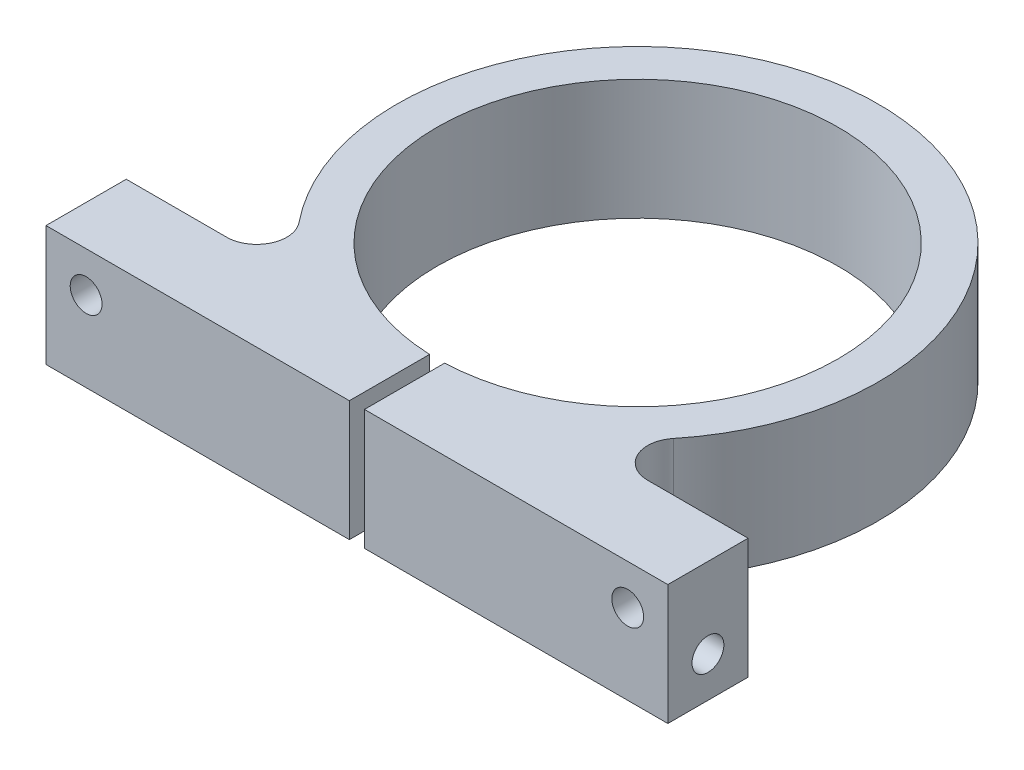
from build123d import *

# Parameters (mm, degrees)
EXTRUDE1_DEPTH          = 38.1
F_3_8_CLEARANCE_HOLE2_D = 10.0838
F_3_8_CLEARANCE_HOLE1_D = 10.0838
F_3_8_CLEARANCE_HOLE3_D = 10.0838


with BuildPart() as part:
    # Sketch1 → Extrude1 (new body)
    with BuildSketch(Plane(origin=(0, 0, 0), x_dir=(1, 0, 0), z_dir=(0, 1, 0))):
        with BuildLine():
            Line((2.3876, -88.855097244), (98.425, -88.855097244))
            Line((98.425, -88.855097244), (98.425, -63.455097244))
            Line((98.425, -63.455097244), (66.635727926, -63.455097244))
            ThreePointArc((66.635727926, -63.455097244), (58.039169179, -58.031902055), (59.231758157, -47.937864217))
            ThreePointArc((59.231758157, -47.937864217), (0, 76.2), (-59.231758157, -47.937864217))
            ThreePointArc((-59.231758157, -47.937864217), (-58.039169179, -58.031902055), (-66.635727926, -63.455097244))
            Line((-66.635727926, -63.455097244), (-98.425, -63.455097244))
            Line((-98.425, -63.455097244), (-98.425, -88.855097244))
            Line((-98.425, -88.855097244), (-2.3876, -88.855097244))
            Line((-2.3876, -88.855097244), (-2.3876, -63.455097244))
            ThreePointArc((-2.3876, -63.455097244), (0, 63.5), (2.3876, -63.455097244))
            Line((2.3876, -63.455097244), (2.3876, -88.855097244))
        make_face()
    extrude(amount=EXTRUDE1_DEPTH)

    # 3_8 Clearance Hole2 (through all)
    with Locations(Plane(origin=(-98.425, 12.7, 76.155097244), x_dir=(0, 0, -1), z_dir=(-1, 0, 0))):
        with Locations((0, 0)):
            Hole(F_3_8_CLEARANCE_HOLE2_D / 2)

    # 3_8 Clearance Hole1 (through all)
    with Locations(Plane(origin=(-85.725, 25.4, 63.455097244), x_dir=(-1, 0, 0), z_dir=(0, 0, -1))):
        with Locations((0, 0)):
            Hole(F_3_8_CLEARANCE_HOLE1_D / 2)

    # 3_8 Clearance Hole3 (through all)
    with Locations(Plane(origin=(85.725, 25.4, 63.455097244), x_dir=(-1, 0, 0), z_dir=(0, 0, -1))):
        with Locations((0, 0)):
            Hole(F_3_8_CLEARANCE_HOLE3_D / 2)


solid = part.part
